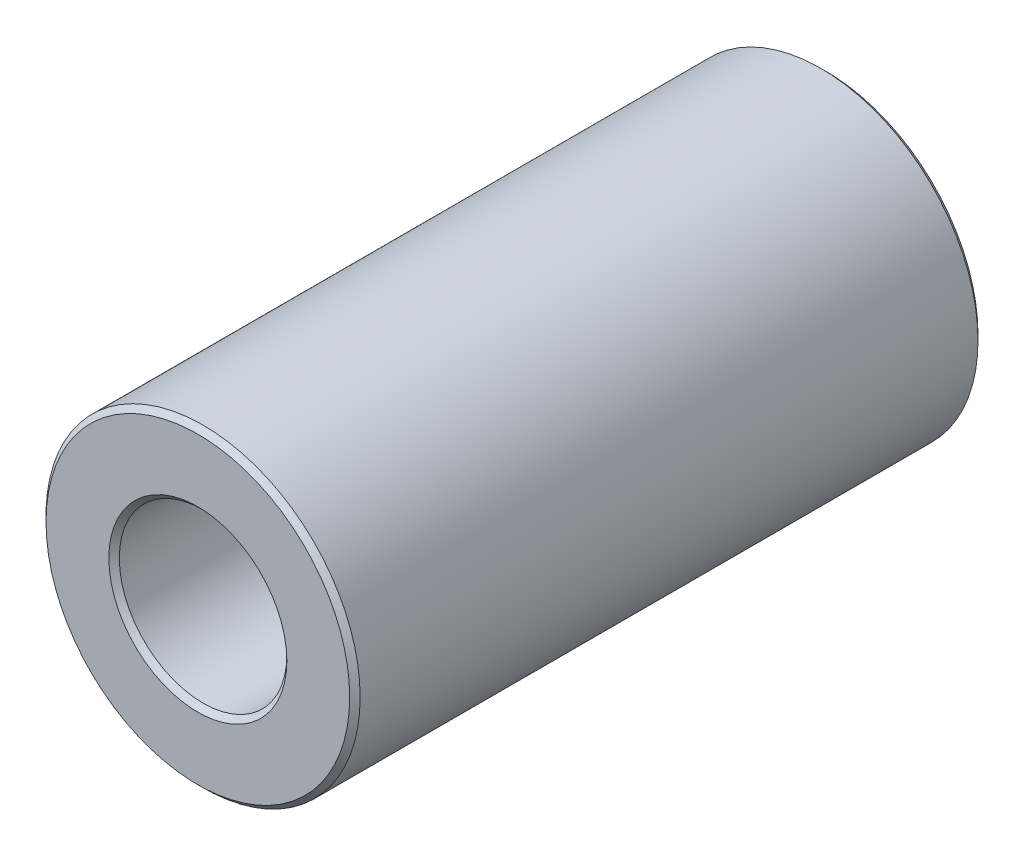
from build123d import *

# Parameters (mm, degrees)
SKETCH1_R           = 3
SKETCH1_R_2         = 1.6
BOSS_EXTRUDE2_DEPTH = 6
CHAMFER3_SIZE       = 0.1


with BuildPart() as part:
    # Sketch1 → Boss-Extrude2 (new, symmetric)
    with BuildSketch(Plane.XY):
        Circle(SKETCH1_R)
        Circle(SKETCH1_R_2, mode=Mode.SUBTRACT)
    extrude(amount=BOSS_EXTRUDE2_DEPTH, both=True)

    # Chamfer3
    chamfer3_edges = [part.edges().sort_by_distance(p)[0] for p in [
        (-3, 0, -6),
        (-3, 0, 6),
        (-1.6, 0, -6),
        (-1.6, 0, 6),
    ]]
    chamfer(chamfer3_edges, length=CHAMFER3_SIZE)


solid = part.part
